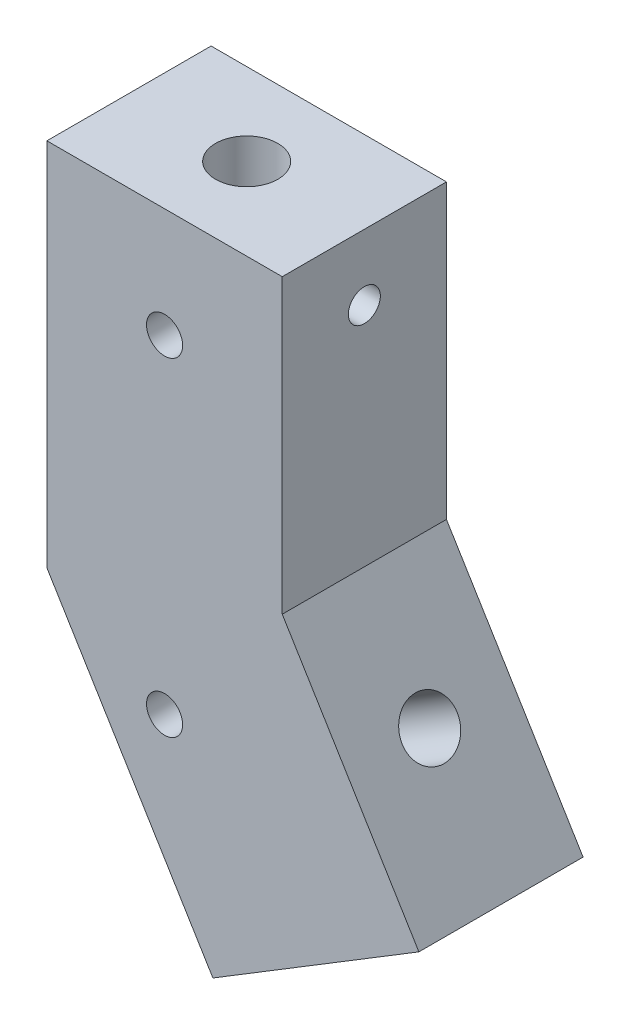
ISO-10303-21;
HEADER;
FILE_DESCRIPTION(('STEP AP214'),'2;1');
FILE_NAME('part.step','',(''),(''),'','','');
FILE_SCHEMA(('AUTOMOTIVE_DESIGN { 1 0 10303 214 1 1 1 1 }'));
ENDSEC;
DATA;
#1=APPLICATION_CONTEXT('core data for automotive mechanical design processes');
#2=APPLICATION_PROTOCOL_DEFINITION('international standard','automotive_design',2000,#1);
#3=PRODUCT_CONTEXT('',#1,'mechanical');
#4=PRODUCT('Part','Part','',(#3));
#5=PRODUCT_RELATED_PRODUCT_CATEGORY('part','',(#4));
#6=PRODUCT_DEFINITION_FORMATION('','',#4);
#7=PRODUCT_DEFINITION_CONTEXT('part definition',#1,'design');
#8=PRODUCT_DEFINITION('design','',#6,#7);
#9=PRODUCT_DEFINITION_SHAPE('','',#8);
#10=(LENGTH_UNIT() NAMED_UNIT(*) SI_UNIT(.MILLI.,.METRE.));
#11=(NAMED_UNIT(*) PLANE_ANGLE_UNIT() SI_UNIT($,.RADIAN.));
#12=(NAMED_UNIT(*) SI_UNIT($,.STERADIAN.) SOLID_ANGLE_UNIT());
#13=UNCERTAINTY_MEASURE_WITH_UNIT(LENGTH_MEASURE(1.E-05),#10,'distance_accuracy_value','');
#14=(GEOMETRIC_REPRESENTATION_CONTEXT(3) GLOBAL_UNCERTAINTY_ASSIGNED_CONTEXT((#13)) GLOBAL_UNIT_ASSIGNED_CONTEXT((#10,
#11,#12)) REPRESENTATION_CONTEXT('',''));
#15=CARTESIAN_POINT('',(0.,0.,0.));
#16=DIRECTION('',(0.,0.,1.));
#17=DIRECTION('',(1.,0.,0.));
#18=AXIS2_PLACEMENT_3D('',#15,#16,#17);
#19=CARTESIAN_POINT('',(20.3073467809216,-542.759067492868,15.));
#20=DIRECTION('',(0.853796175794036,0.520607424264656,0.));
#21=DIRECTION('',(-0.520607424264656,0.853796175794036,0.));
#22=AXIS2_PLACEMENT_3D('',#19,#20,#21);
#23=PLANE('',#22);
#24=CARTESIAN_POINT('',(-4.20268614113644,-502.562613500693,0.));
#25=DIRECTION('',(0.853796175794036,0.520607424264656,0.));
#26=DIRECTION('',(-0.520607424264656,0.853796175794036,0.));
#27=AXIS2_PLACEMENT_3D('',#24,#25,#26);
#28=CIRCLE('',#27,5.02899389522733);
#29=CARTESIAN_POINT('',(-6.82081769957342,-498.268877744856,0.));
#30=VERTEX_POINT('',#29);
#31=EDGE_CURVE('E186',#30,#30,#28,.T.);
#32=ORIENTED_EDGE('',*,*,#31,.T.);
#33=EDGE_LOOP('',(#32));
#34=FACE_BOUND('',#33,.T.);
#35=DIRECTION('',(0.520607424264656,-0.853796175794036,0.));
#36=VECTOR('',#35,1.);
#37=CARTESIAN_POINT('',(20.3073467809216,-542.759067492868,-15.));
#38=LINE('',#37,#36);
#39=CARTESIAN_POINT('',(-21.5,-474.195018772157,-15.));
#40=VERTEX_POINT('',#39);
#41=CARTESIAN_POINT('',(8.82759390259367,-523.93227277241,-15.));
#42=VERTEX_POINT('',#41);
#43=EDGE_CURVE('E108',#40,#42,#38,.T.);
#44=ORIENTED_EDGE('',*,*,#43,.T.);
#45=DIRECTION('',(0.,0.,1.));
#46=VECTOR('',#45,1.);
#47=CARTESIAN_POINT('',(8.82759390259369,-523.93227277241,15.));
#48=LINE('',#47,#46);
#49=CARTESIAN_POINT('',(8.82759390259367,-523.93227277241,15.));
#50=VERTEX_POINT('',#49);
#51=EDGE_CURVE('E190',#42,#50,#48,.T.);
#52=ORIENTED_EDGE('',*,*,#51,.T.);
#53=DIRECTION('',(0.520607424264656,-0.853796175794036,0.));
#54=VECTOR('',#53,1.);
#55=CARTESIAN_POINT('',(20.3073467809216,-542.759067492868,15.));
#56=LINE('',#55,#54);
#57=CARTESIAN_POINT('',(-21.5,-474.195018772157,15.));
#58=VERTEX_POINT('',#57);
#59=EDGE_CURVE('E107',#58,#50,#56,.T.);
#60=ORIENTED_EDGE('',*,*,#59,.F.);
#61=DIRECTION('',(0.,0.,-1.));
#62=VECTOR('',#61,1.);
#63=CARTESIAN_POINT('',(-21.5,-474.195018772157,15.));
#64=LINE('',#63,#62);
#65=EDGE_CURVE('E191',#58,#40,#64,.T.);
#66=ORIENTED_EDGE('',*,*,#65,.T.);
#67=EDGE_LOOP('',(#44,#52,#60,#66));
#68=FACE_BOUND('',#67,.T.);
#69=ADVANCED_FACE('F33',(#34,#68),#23,.F.);
#70=CARTESIAN_POINT('',(-62.7003126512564,-406.626506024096,15.));
#71=DIRECTION('',(0.,-1.,0.));
#72=DIRECTION('',(0.,0.,-1.));
#73=AXIS2_PLACEMENT_3D('',#70,#71,#72);
#74=PLANE('',#73);
#75=CARTESIAN_POINT('',(0.,-406.626506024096,0.));
#76=DIRECTION('',(0.,1.,0.));
#77=DIRECTION('',(0.,0.,1.));
#78=AXIS2_PLACEMENT_3D('',#75,#76,#77);
#79=CIRCLE('',#78,5.68882024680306);
#80=CARTESIAN_POINT('',(0.,-406.626506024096,5.68882024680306));
#81=VERTEX_POINT('',#80);
#82=EDGE_CURVE('E211',#81,#81,#79,.T.);
#83=ORIENTED_EDGE('',*,*,#82,.F.);
#84=EDGE_LOOP('',(#83));
#85=FACE_BOUND('',#84,.T.);
#86=DIRECTION('',(-1.,0.,0.));
#87=VECTOR('',#86,1.);
#88=CARTESIAN_POINT('',(-62.7003126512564,-406.626506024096,15.));
#89=LINE('',#88,#87);
#90=CARTESIAN_POINT('',(21.5,-406.626506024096,15.));
#91=VERTEX_POINT('',#90);
#92=CARTESIAN_POINT('',(-21.5,-406.626506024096,15.));
#93=VERTEX_POINT('',#92);
#94=EDGE_CURVE('E111',#91,#93,#89,.T.);
#95=ORIENTED_EDGE('',*,*,#94,.F.);
#96=DIRECTION('',(0.,0.,-1.));
#97=VECTOR('',#96,1.);
#98=CARTESIAN_POINT('',(21.5,-406.626506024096,15.));
#99=LINE('',#98,#97);
#100=CARTESIAN_POINT('',(21.5,-406.626506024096,-15.));
#101=VERTEX_POINT('',#100);
#102=EDGE_CURVE('E202',#91,#101,#99,.T.);
#103=ORIENTED_EDGE('',*,*,#102,.T.);
#104=DIRECTION('',(-1.,0.,0.));
#105=VECTOR('',#104,1.);
#106=CARTESIAN_POINT('',(-62.7003126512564,-406.626506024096,-15.));
#107=LINE('',#106,#105);
#108=CARTESIAN_POINT('',(-21.5,-406.626506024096,-15.));
#109=VERTEX_POINT('',#108);
#110=EDGE_CURVE('E56',#101,#109,#107,.T.);
#111=ORIENTED_EDGE('',*,*,#110,.T.);
#112=DIRECTION('',(0.,0.,1.));
#113=VECTOR('',#112,1.);
#114=CARTESIAN_POINT('',(-21.5,-406.626506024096,15.));
#115=LINE('',#114,#113);
#116=EDGE_CURVE('E207',#109,#93,#115,.T.);
#117=ORIENTED_EDGE('',*,*,#116,.T.);
#118=EDGE_LOOP('',(#95,#103,#111,#117));
#119=FACE_BOUND('',#118,.T.);
#120=ADVANCED_FACE('F176',(#85,#119),#74,.F.);
#121=CARTESIAN_POINT('',(0.,0.,15.));
#122=DIRECTION('',(0.,0.,1.));
#123=DIRECTION('',(1.,0.,0.));
#124=AXIS2_PLACEMENT_3D('',#121,#122,#123);
#125=PLANE('',#124);
#126=CARTESIAN_POINT('',(0.,-486.626506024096,15.));
#127=DIRECTION('',(0.,0.,1.));
#128=DIRECTION('',(1.,0.,0.));
#129=AXIS2_PLACEMENT_3D('',#126,#127,#128);
#130=CIRCLE('',#129,3.30000000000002);
#131=CARTESIAN_POINT('',(3.30000000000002,-486.626506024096,15.));
#132=VERTEX_POINT('',#131);
#133=EDGE_CURVE('E229',#132,#132,#130,.T.);
#134=ORIENTED_EDGE('',*,*,#133,.F.);
#135=EDGE_LOOP('',(#134));
#136=FACE_BOUND('',#135,.T.);
#137=CARTESIAN_POINT('',(0.,-426.626506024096,15.));
#138=DIRECTION('',(0.,0.,1.));
#139=DIRECTION('',(1.,0.,0.));
#140=AXIS2_PLACEMENT_3D('',#137,#138,#139);
#141=CIRCLE('',#140,3.30000000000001);
#142=CARTESIAN_POINT('',(3.30000000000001,-426.626506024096,15.));
#143=VERTEX_POINT('',#142);
#144=EDGE_CURVE('E232',#143,#143,#141,.T.);
#145=ORIENTED_EDGE('',*,*,#144,.F.);
#146=EDGE_LOOP('',(#145));
#147=FACE_BOUND('',#146,.T.);
#148=DIRECTION('',(0.,-1.,0.));
#149=VECTOR('',#148,1.);
#150=CARTESIAN_POINT('',(21.5,-402.104856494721,15.));
#151=LINE('',#150,#149);
#152=CARTESIAN_POINT('',(21.5,-460.034183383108,15.));
#153=VERTEX_POINT('',#152);
#154=EDGE_CURVE('E91',#91,#153,#151,.T.);
#155=ORIENTED_EDGE('',*,*,#154,.F.);
#156=ORIENTED_EDGE('',*,*,#94,.T.);
#157=DIRECTION('',(0.,1.,0.));
#158=VECTOR('',#157,1.);
#159=CARTESIAN_POINT('',(-21.5,-402.104856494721,15.));
#160=LINE('',#159,#158);
#161=EDGE_CURVE('E204',#58,#93,#160,.T.);
#162=ORIENTED_EDGE('',*,*,#161,.F.);
#163=ORIENTED_EDGE('',*,*,#59,.T.);
#164=DIRECTION('',(-0.853796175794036,-0.520607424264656,0.));
#165=VECTOR('',#164,1.);
#166=CARTESIAN_POINT('',(46.4676009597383,-500.981048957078,15.));
#167=LINE('',#166,#165);
#168=CARTESIAN_POINT('',(46.4676009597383,-500.981048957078,15.));
#169=VERTEX_POINT('',#168);
#170=EDGE_CURVE('E102',#169,#50,#167,.T.);
#171=ORIENTED_EDGE('',*,*,#170,.F.);
#172=DIRECTION('',(0.520607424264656,-0.853796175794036,0.));
#173=VECTOR('',#172,1.);
#174=CARTESIAN_POINT('',(46.4676009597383,-500.981048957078,15.));
#175=LINE('',#174,#173);
#176=EDGE_CURVE('E196',#153,#169,#175,.T.);
#177=ORIENTED_EDGE('',*,*,#176,.F.);
#178=EDGE_LOOP('',(#155,#156,#162,#163,#171,#177));
#179=FACE_BOUND('',#178,.T.);
#180=ADVANCED_FACE('F181',(#136,#147,#179),#125,.T.);
#181=CARTESIAN_POINT('',(0.,0.,-15.));
#182=DIRECTION('',(0.,0.,1.));
#183=DIRECTION('',(1.,0.,0.));
#184=AXIS2_PLACEMENT_3D('',#181,#182,#183);
#185=PLANE('',#184);
#186=CARTESIAN_POINT('',(0.,-486.626506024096,-15.));
#187=DIRECTION('',(0.,0.,1.));
#188=DIRECTION('',(1.,0.,0.));
#189=AXIS2_PLACEMENT_3D('',#186,#187,#188);
#190=CIRCLE('',#189,3.30000000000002);
#191=CARTESIAN_POINT('',(3.30000000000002,-486.626506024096,-15.));
#192=VERTEX_POINT('',#191);
#193=EDGE_CURVE('E233',#192,#192,#190,.T.);
#194=ORIENTED_EDGE('',*,*,#193,.T.);
#195=EDGE_LOOP('',(#194));
#196=FACE_BOUND('',#195,.T.);
#197=CARTESIAN_POINT('',(0.,-426.626506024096,-15.));
#198=DIRECTION('',(0.,0.,1.));
#199=DIRECTION('',(1.,0.,0.));
#200=AXIS2_PLACEMENT_3D('',#197,#198,#199);
#201=CIRCLE('',#200,3.30000000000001);
#202=CARTESIAN_POINT('',(3.30000000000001,-426.626506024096,-15.));
#203=VERTEX_POINT('',#202);
#204=EDGE_CURVE('E197',#203,#203,#201,.T.);
#205=ORIENTED_EDGE('',*,*,#204,.T.);
#206=EDGE_LOOP('',(#205));
#207=FACE_BOUND('',#206,.T.);
#208=ORIENTED_EDGE('',*,*,#110,.F.);
#209=DIRECTION('',(0.,-1.,0.));
#210=VECTOR('',#209,1.);
#211=CARTESIAN_POINT('',(21.5,0.,-15.));
#212=LINE('',#211,#210);
#213=CARTESIAN_POINT('',(21.5,-460.034183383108,-15.));
#214=VERTEX_POINT('',#213);
#215=EDGE_CURVE('E11',#101,#214,#212,.T.);
#216=ORIENTED_EDGE('',*,*,#215,.T.);
#217=DIRECTION('',(0.520607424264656,-0.853796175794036,0.));
#218=VECTOR('',#217,1.);
#219=CARTESIAN_POINT('',(46.4676009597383,-500.981048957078,-15.));
#220=LINE('',#219,#218);
#221=CARTESIAN_POINT('',(46.4676009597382,-500.981048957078,-15.));
#222=VERTEX_POINT('',#221);
#223=EDGE_CURVE('E98',#214,#222,#220,.T.);
#224=ORIENTED_EDGE('',*,*,#223,.T.);
#225=DIRECTION('',(-0.853796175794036,-0.520607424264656,0.));
#226=VECTOR('',#225,1.);
#227=CARTESIAN_POINT('',(46.4676009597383,-500.981048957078,-15.));
#228=LINE('',#227,#226);
#229=EDGE_CURVE('E48',#222,#42,#228,.T.);
#230=ORIENTED_EDGE('',*,*,#229,.T.);
#231=ORIENTED_EDGE('',*,*,#43,.F.);
#232=DIRECTION('',(0.,1.,0.));
#233=VECTOR('',#232,1.);
#234=CARTESIAN_POINT('',(-21.5,0.,-15.));
#235=LINE('',#234,#233);
#236=EDGE_CURVE('E41',#40,#109,#235,.T.);
#237=ORIENTED_EDGE('',*,*,#236,.T.);
#238=EDGE_LOOP('',(#208,#216,#224,#230,#231,#237));
#239=FACE_BOUND('',#238,.T.);
#240=ADVANCED_FACE('F104',(#196,#207,#239),#185,.F.);
#241=CARTESIAN_POINT('',(0.,-436.626506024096,0.));
#242=DIRECTION('',(0.,1.,0.));
#243=DIRECTION('',(0.,0.,1.));
#244=AXIS2_PLACEMENT_3D('',#241,#242,#243);
#245=CYLINDRICAL_SURFACE('',#244,5.68882024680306);
#246=CARTESIAN_POINT('',(4.87924695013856,-418.626506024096,2.925));
#247=CARTESIAN_POINT('',(4.87924763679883,-418.702409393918,2.92499936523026));
#248=CARTESIAN_POINT('',(4.88102612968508,-418.778317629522,2.92203955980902));
#249=CARTESIAN_POINT('',(4.88806151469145,-418.929524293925,2.91025242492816));
#250=CARTESIAN_POINT('',(4.89331989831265,-419.004822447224,2.90142257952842));
#251=CARTESIAN_POINT('',(4.91407437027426,-419.229115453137,2.86624275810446));
#252=CARTESIAN_POINT('',(4.93454934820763,-419.376393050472,2.83120272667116));
#253=CARTESIAN_POINT('',(4.98578154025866,-419.661208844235,2.73994966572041));
#254=CARTESIAN_POINT('',(5.01648149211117,-419.798796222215,2.6838543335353));
#255=CARTESIAN_POINT('',(5.08460156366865,-420.06260147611,2.55244438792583));
#256=CARTESIAN_POINT('',(5.12202236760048,-420.188818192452,2.47712781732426));
#257=CARTESIAN_POINT('',(5.20336614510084,-420.438441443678,2.30169188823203));
#258=CARTESIAN_POINT('',(5.24757155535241,-420.560635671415,2.19997889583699));
#259=CARTESIAN_POINT('',(5.33522835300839,-420.787184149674,1.97794514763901));
#260=CARTESIAN_POINT('',(5.37867933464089,-420.891529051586,1.85761470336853));
#261=CARTESIAN_POINT('',(5.46368560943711,-421.086809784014,1.59114108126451));
#262=CARTESIAN_POINT('',(5.50487675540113,-421.176230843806,1.44376068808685));
#263=CARTESIAN_POINT('',(5.57701230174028,-421.328453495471,1.13353212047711));
#264=CARTESIAN_POINT('',(5.60796353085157,-421.391272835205,0.970694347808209));
#265=CARTESIAN_POINT('',(5.65408918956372,-421.483628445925,0.647029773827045));
#266=CARTESIAN_POINT('',(5.67026752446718,-421.515296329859,0.486957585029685));
#267=CARTESIAN_POINT('',(5.68879196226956,-421.551494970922,0.163019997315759));
#268=CARTESIAN_POINT('',(5.69114699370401,-421.556043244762,-0.000842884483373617));
#269=CARTESIAN_POINT('',(5.68221256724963,-421.538638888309,-0.311579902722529));
#270=CARTESIAN_POINT('',(5.67215625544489,-421.519081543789,-0.458632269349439));
#271=CARTESIAN_POINT('',(5.64142391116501,-421.458342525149,-0.74702399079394));
#272=CARTESIAN_POINT('',(5.62074707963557,-421.417159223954,-0.888362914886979));
#273=CARTESIAN_POINT('',(5.57031092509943,-421.314135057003,-1.16369162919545));
#274=CARTESIAN_POINT('',(5.54043575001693,-421.252029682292,-1.29756034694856));
#275=CARTESIAN_POINT('',(5.47425377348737,-421.109326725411,-1.55328477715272));
#276=CARTESIAN_POINT('',(5.43794472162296,-421.028722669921,-1.67513626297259));
#277=CARTESIAN_POINT('',(5.35804101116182,-420.842207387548,-1.91617775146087));
#278=CARTESIAN_POINT('',(5.31408100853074,-420.734586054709,-2.03392508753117));
#279=CARTESIAN_POINT('',(5.22605480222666,-420.501673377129,-2.2504932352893));
#280=CARTESIAN_POINT('',(5.18198854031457,-420.376367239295,-2.349298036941));
#281=CARTESIAN_POINT('',(5.09533294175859,-420.100803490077,-2.53203530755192));
#282=CARTESIAN_POINT('',(5.05306266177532,-419.949413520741,-2.61444351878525));
#283=CARTESIAN_POINT('',(4.99788932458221,-419.711775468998,-2.71759057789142));
#284=CARTESIAN_POINT('',(4.98086776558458,-419.630787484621,-2.74856600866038));
#285=CARTESIAN_POINT('',(4.95024593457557,-419.46581240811,-2.80334212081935));
#286=CARTESIAN_POINT('',(4.93664349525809,-419.381827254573,-2.82714734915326));
#287=CARTESIAN_POINT('',(4.91439721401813,-419.218346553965,-2.86562908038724));
#288=CARTESIAN_POINT('',(4.90544398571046,-419.13902855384,-2.88088305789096));
#289=CARTESIAN_POINT('',(4.89132297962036,-418.979107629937,-2.90479410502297));
#290=CARTESIAN_POINT('',(4.88615317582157,-418.898505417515,-2.91345470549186));
#291=CARTESIAN_POINT('',(4.87982349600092,-418.736733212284,-2.92404500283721));
#292=CARTESIAN_POINT('',(4.87866181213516,-418.655563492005,-2.92597773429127));
#293=CARTESIAN_POINT('',(4.88038663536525,-418.493413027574,-2.92309711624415));
#294=CARTESIAN_POINT('',(4.88327282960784,-418.412432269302,-2.91828428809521));
#295=CARTESIAN_POINT('',(4.89669192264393,-418.190076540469,-2.89575814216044));
#296=CARTESIAN_POINT('',(4.91136993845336,-418.049589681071,-2.87101916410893));
#297=CARTESIAN_POINT('',(4.95109180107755,-417.775154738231,-2.80194757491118));
#298=CARTESIAN_POINT('',(4.97613926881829,-417.641208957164,-2.75760811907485));
#299=CARTESIAN_POINT('',(5.03508609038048,-417.376525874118,-2.64850660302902));
#300=CARTESIAN_POINT('',(5.06933820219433,-417.24621621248,-2.58290248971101));
#301=CARTESIAN_POINT('',(5.14256077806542,-416.997696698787,-2.43385168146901));
#302=CARTESIAN_POINT('',(5.18153366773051,-416.87949312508,-2.35039579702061));
#303=CARTESIAN_POINT('',(5.26611458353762,-416.641850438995,-2.15488168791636));
#304=CARTESIAN_POINT('',(5.31190883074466,-416.524392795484,-2.04048432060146));
#305=CARTESIAN_POINT('',(5.40048104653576,-416.309672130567,-1.79297447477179));
#306=CARTESIAN_POINT('',(5.44325779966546,-416.212417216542,-1.65985451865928));
#307=CARTESIAN_POINT('',(5.52273975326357,-416.038104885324,-1.37290350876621));
#308=CARTESIAN_POINT('',(5.55920341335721,-415.961803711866,-1.21854127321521));
#309=CARTESIAN_POINT('',(5.62007271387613,-415.837034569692,-0.896757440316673));
#310=CARTESIAN_POINT('',(5.64448952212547,-415.788540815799,-0.729348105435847));
#311=CARTESIAN_POINT('',(5.67663699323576,-415.725158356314,-0.403373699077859));
#312=CARTESIAN_POINT('',(5.6857318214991,-415.707516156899,-0.245478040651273));
#313=CARTESIAN_POINT('',(5.69057481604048,-415.698090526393,0.0712640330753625));
#314=CARTESIAN_POINT('',(5.68632822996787,-415.706296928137,0.230110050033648));
#315=CARTESIAN_POINT('',(5.66575542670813,-415.746576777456,0.532136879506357));
#316=CARTESIAN_POINT('',(5.65032303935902,-415.776885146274,0.675620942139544));
#317=CARTESIAN_POINT('',(5.60983350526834,-415.858038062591,0.95520026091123));
#318=CARTESIAN_POINT('',(5.58477505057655,-415.908885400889,1.09129451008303));
#319=CARTESIAN_POINT('',(5.52599106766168,-416.031789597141,1.35852398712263));
#320=CARTESIAN_POINT('',(5.49195273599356,-416.104629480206,1.48922815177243));
#321=CARTESIAN_POINT('',(5.41866907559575,-416.268478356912,1.7370754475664));
#322=CARTESIAN_POINT('',(5.37942139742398,-416.35949555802,1.8542124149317));
#323=CARTESIAN_POINT('',(5.29472053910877,-416.568104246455,2.08451124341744));
#324=CARTESIAN_POINT('',(5.24904713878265,-416.687477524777,2.19598339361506));
#325=CARTESIAN_POINT('',(5.159894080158,-416.943676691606,2.39799592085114));
#326=CARTESIAN_POINT('',(5.11641659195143,-417.0805193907,2.48851589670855));
#327=CARTESIAN_POINT('',(5.03509255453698,-417.375180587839,2.64934180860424));
#328=CARTESIAN_POINT('',(4.9975465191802,-417.533625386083,2.71867714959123));
#329=CARTESIAN_POINT('',(4.95147811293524,-417.779970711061,2.80116320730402));
#330=CARTESIAN_POINT('',(4.93783801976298,-417.86345395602,2.82506066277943));
#331=CARTESIAN_POINT('',(4.91453238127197,-418.032723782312,2.86541389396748));
#332=CARTESIAN_POINT('',(4.90486411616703,-418.118508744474,2.88187476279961));
#333=CARTESIAN_POINT('',(4.89142663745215,-418.274625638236,2.90460953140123));
#334=CARTESIAN_POINT('',(4.88687323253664,-418.344696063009,2.91224664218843));
#335=CARTESIAN_POINT('',(4.8807829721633,-418.485344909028,2.92244233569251));
#336=CARTESIAN_POINT('',(4.87924631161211,-418.5559233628,2.92500059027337));
#337=CARTESIAN_POINT('',(4.87924695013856,-418.626506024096,2.925));
#338=B_SPLINE_CURVE_WITH_KNOTS('',3,(#246,#247,#248,#249,#250,#251,#252,#253,#254,#255,#256,
#257,#258,#259,#260,#261,#262,#263,#264,#265,#266,#267,#268,#269,#270,#271,#272,#273,#274,#275,
#276,#277,#278,#279,#280,#281,#282,#283,#284,#285,#286,#287,#288,#289,#290,#291,#292,#293,#294,
#295,#296,#297,#298,#299,#300,#301,#302,#303,#304,#305,#306,#307,#308,#309,#310,#311,#312,#313,
#314,#315,#316,#317,#318,#319,#320,#321,#322,#323,#324,#325,#326,#327,#328,#329,#330,#331,#332,
#333,#334,#335,#336,#337),.UNSPECIFIED.,.T.,.F.,(4,2,2,2,2,2,2,2,2,2,2,2,2,2,2,2,2,2,2,2,2,2,2,
2,2,2,2,2,2,2,2,2,2,2,2,2,2,2,2,2,2,2,2,2,2,4),(0.,0.227632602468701,0.455362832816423,
0.911165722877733,1.36445776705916,1.81779598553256,2.31080256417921,2.80406657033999,
3.33299103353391,3.86156205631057,4.35073934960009,4.83960064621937,5.28356862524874,
5.72757001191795,6.17740964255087,6.62740692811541,7.12169986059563,7.61640874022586,
8.145730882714,8.41049294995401,8.67508676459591,8.91853643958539,9.16185565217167,
9.40506510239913,9.64825575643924,10.0763225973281,10.5045390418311,10.9523601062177,
11.400412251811,11.9088638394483,12.4175190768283,12.9426499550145,13.4672931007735,
13.9421237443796,14.4167676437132,14.8571593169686,15.2976108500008,15.7560927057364,
16.2147820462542,16.7213261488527,17.2283614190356,17.7559951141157,18.0193431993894,
18.2825106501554,18.4941728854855,18.7058487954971),.UNSPECIFIED.);
#339=CARTESIAN_POINT('',(4.87924695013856,-418.626506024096,2.925));
#340=VERTEX_POINT('',#339);
#341=EDGE_CURVE('E240',#340,#340,#338,.T.);
#342=ORIENTED_EDGE('',*,*,#341,.T.);
#343=EDGE_LOOP('',(#342));
#344=FACE_BOUND('',#343,.T.);
#345=CARTESIAN_POINT('',(-4.87924695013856,-418.626506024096,2.925));
#346=CARTESIAN_POINT('',(-4.87924763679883,-418.550602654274,2.92499936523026));
#347=CARTESIAN_POINT('',(-4.88102612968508,-418.47469441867,2.92203955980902));
#348=CARTESIAN_POINT('',(-4.88806151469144,-418.323487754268,2.91025242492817));
#349=CARTESIAN_POINT('',(-4.89331989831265,-418.248189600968,2.90142257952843));
#350=CARTESIAN_POINT('',(-4.91407437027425,-418.023896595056,2.86624275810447));
#351=CARTESIAN_POINT('',(-4.93454934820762,-417.87661899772,2.83120272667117));
#352=CARTESIAN_POINT('',(-4.98578154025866,-417.591803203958,2.73994966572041));
#353=CARTESIAN_POINT('',(-5.01648149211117,-417.454215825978,2.6838543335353));
#354=CARTESIAN_POINT('',(-5.08460156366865,-417.190410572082,2.55244438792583));
#355=CARTESIAN_POINT('',(-5.12202236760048,-417.064193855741,2.47712781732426));
#356=CARTESIAN_POINT('',(-5.20336614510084,-416.814570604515,2.30169188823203));
#357=CARTESIAN_POINT('',(-5.24757155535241,-416.692376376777,2.19997889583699));
#358=CARTESIAN_POINT('',(-5.33522835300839,-416.465827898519,1.97794514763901));
#359=CARTESIAN_POINT('',(-5.37867933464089,-416.361482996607,1.85761470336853));
#360=CARTESIAN_POINT('',(-5.46368560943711,-416.166202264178,1.59114108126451));
#361=CARTESIAN_POINT('',(-5.50487675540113,-416.076781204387,1.44376068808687));
#362=CARTESIAN_POINT('',(-5.57701230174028,-415.924558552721,1.13353212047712));
#363=CARTESIAN_POINT('',(-5.60796353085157,-415.861739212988,0.970694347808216));
#364=CARTESIAN_POINT('',(-5.65408918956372,-415.769383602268,0.647029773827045));
#365=CARTESIAN_POINT('',(-5.67026752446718,-415.737715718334,0.486957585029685));
#366=CARTESIAN_POINT('',(-5.68879196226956,-415.701517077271,0.16301999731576));
#367=CARTESIAN_POINT('',(-5.69114699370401,-415.696968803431,-0.000842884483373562));
#368=CARTESIAN_POINT('',(-5.68221256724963,-415.714373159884,-0.311579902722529));
#369=CARTESIAN_POINT('',(-5.67215625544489,-415.733930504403,-0.458632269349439));
#370=CARTESIAN_POINT('',(-5.64142391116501,-415.794669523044,-0.74702399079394));
#371=CARTESIAN_POINT('',(-5.62074707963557,-415.835852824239,-0.888362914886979));
#372=CARTESIAN_POINT('',(-5.57031092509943,-415.93887699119,-1.16369162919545));
#373=CARTESIAN_POINT('',(-5.54043575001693,-416.000982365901,-1.29756034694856));
#374=CARTESIAN_POINT('',(-5.47425377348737,-416.143685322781,-1.55328477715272));
#375=CARTESIAN_POINT('',(-5.43794472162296,-416.224289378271,-1.67513626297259));
#376=CARTESIAN_POINT('',(-5.35804101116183,-416.410804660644,-1.91617775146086));
#377=CARTESIAN_POINT('',(-5.31408100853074,-416.518425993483,-2.03392508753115));
#378=CARTESIAN_POINT('',(-5.22605480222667,-416.751338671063,-2.25049323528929));
#379=CARTESIAN_POINT('',(-5.18198854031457,-416.876644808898,-2.34929803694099));
#380=CARTESIAN_POINT('',(-5.09533294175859,-417.152208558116,-2.53203530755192));
#381=CARTESIAN_POINT('',(-5.05306266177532,-417.303598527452,-2.61444351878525));
#382=CARTESIAN_POINT('',(-4.99788932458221,-417.541236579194,-2.71759057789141));
#383=CARTESIAN_POINT('',(-4.98086776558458,-417.622224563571,-2.74856600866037));
#384=CARTESIAN_POINT('',(-4.95024593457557,-417.787199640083,-2.80334212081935));
#385=CARTESIAN_POINT('',(-4.93664349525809,-417.871184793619,-2.82714734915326));
#386=CARTESIAN_POINT('',(-4.91439721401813,-418.034665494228,-2.86562908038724));
#387=CARTESIAN_POINT('',(-4.90544398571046,-418.113983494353,-2.88088305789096));
#388=CARTESIAN_POINT('',(-4.89132297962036,-418.273904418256,-2.90479410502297));
#389=CARTESIAN_POINT('',(-4.88615317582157,-418.354506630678,-2.91345470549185));
#390=CARTESIAN_POINT('',(-4.87982349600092,-418.516278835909,-2.92404500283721));
#391=CARTESIAN_POINT('',(-4.87866181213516,-418.597448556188,-2.92597773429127));
#392=CARTESIAN_POINT('',(-4.88038663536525,-418.759599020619,-2.92309711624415));
#393=CARTESIAN_POINT('',(-4.88327282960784,-418.84057977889,-2.91828428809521));
#394=CARTESIAN_POINT('',(-4.89669192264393,-419.062935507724,-2.89575814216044));
#395=CARTESIAN_POINT('',(-4.91136993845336,-419.203422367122,-2.87101916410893));
#396=CARTESIAN_POINT('',(-4.95109180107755,-419.477857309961,-2.80194757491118));
#397=CARTESIAN_POINT('',(-4.97613926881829,-419.611803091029,-2.75760811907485));
#398=CARTESIAN_POINT('',(-5.03508609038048,-419.876486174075,-2.64850660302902));
#399=CARTESIAN_POINT('',(-5.06933820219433,-420.006795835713,-2.58290248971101));
#400=CARTESIAN_POINT('',(-5.14256077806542,-420.255315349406,-2.43385168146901));
#401=CARTESIAN_POINT('',(-5.18153366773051,-420.373518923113,-2.35039579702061));
#402=CARTESIAN_POINT('',(-5.26611458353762,-420.611161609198,-2.15488168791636));
#403=CARTESIAN_POINT('',(-5.31190883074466,-420.728619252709,-2.04048432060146));
#404=CARTESIAN_POINT('',(-5.40048104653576,-420.943339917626,-1.79297447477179));
#405=CARTESIAN_POINT('',(-5.44325779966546,-421.040594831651,-1.65985451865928));
#406=CARTESIAN_POINT('',(-5.52273975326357,-421.214907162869,-1.37290350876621));
#407=CARTESIAN_POINT('',(-5.55920341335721,-421.291208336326,-1.21854127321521));
#408=CARTESIAN_POINT('',(-5.62007271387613,-421.415977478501,-0.896757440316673));
#409=CARTESIAN_POINT('',(-5.64448952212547,-421.464471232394,-0.729348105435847));
#410=CARTESIAN_POINT('',(-5.67663699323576,-421.527853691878,-0.403373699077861));
#411=CARTESIAN_POINT('',(-5.6857318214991,-421.545495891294,-0.245478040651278));
#412=CARTESIAN_POINT('',(-5.69057481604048,-421.5549215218,0.071264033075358));
#413=CARTESIAN_POINT('',(-5.68632822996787,-421.546715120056,0.230110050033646));
#414=CARTESIAN_POINT('',(-5.66575542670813,-421.506435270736,0.532136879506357));
#415=CARTESIAN_POINT('',(-5.65032303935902,-421.476126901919,0.675620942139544));
#416=CARTESIAN_POINT('',(-5.60983350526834,-421.394973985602,0.95520026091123));
#417=CARTESIAN_POINT('',(-5.58477505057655,-421.344126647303,1.09129451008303));
#418=CARTESIAN_POINT('',(-5.52599106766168,-421.221222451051,1.35852398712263));
#419=CARTESIAN_POINT('',(-5.49195273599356,-421.148382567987,1.48922815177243));
#420=CARTESIAN_POINT('',(-5.41866907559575,-420.984533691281,1.7370754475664));
#421=CARTESIAN_POINT('',(-5.37942139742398,-420.893516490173,1.8542124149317));
#422=CARTESIAN_POINT('',(-5.29472053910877,-420.684907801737,2.08451124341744));
#423=CARTESIAN_POINT('',(-5.24904713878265,-420.565534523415,2.19598339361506));
#424=CARTESIAN_POINT('',(-5.159894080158,-420.309335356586,2.39799592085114));
#425=CARTESIAN_POINT('',(-5.11641659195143,-420.172492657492,2.48851589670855));
#426=CARTESIAN_POINT('',(-5.03509255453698,-419.877831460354,2.64934180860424));
#427=CARTESIAN_POINT('',(-4.9975465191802,-419.719386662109,2.71867714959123));
#428=CARTESIAN_POINT('',(-4.95147811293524,-419.473041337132,2.80116320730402));
#429=CARTESIAN_POINT('',(-4.93783801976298,-419.389558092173,2.82506066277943));
#430=CARTESIAN_POINT('',(-4.91453238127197,-419.220288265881,2.86541389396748));
#431=CARTESIAN_POINT('',(-4.90486411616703,-419.134503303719,2.88187476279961));
#432=CARTESIAN_POINT('',(-4.89142663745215,-418.978386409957,2.90460953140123));
#433=CARTESIAN_POINT('',(-4.88687323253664,-418.908315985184,2.91224664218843));
#434=CARTESIAN_POINT('',(-4.8807829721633,-418.767667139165,2.92244233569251));
#435=CARTESIAN_POINT('',(-4.87924631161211,-418.697088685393,2.92500059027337));
#436=CARTESIAN_POINT('',(-4.87924695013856,-418.626506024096,2.925));
#437=B_SPLINE_CURVE_WITH_KNOTS('',3,(#345,#346,#347,#348,#349,#350,#351,#352,#353,#354,#355,
#356,#357,#358,#359,#360,#361,#362,#363,#364,#365,#366,#367,#368,#369,#370,#371,#372,#373,#374,
#375,#376,#377,#378,#379,#380,#381,#382,#383,#384,#385,#386,#387,#388,#389,#390,#391,#392,#393,
#394,#395,#396,#397,#398,#399,#400,#401,#402,#403,#404,#405,#406,#407,#408,#409,#410,#411,#412,
#413,#414,#415,#416,#417,#418,#419,#420,#421,#422,#423,#424,#425,#426,#427,#428,#429,#430,#431,
#432,#433,#434,#435,#436),.UNSPECIFIED.,.T.,.F.,(4,2,2,2,2,2,2,2,2,2,2,2,2,2,2,2,2,2,2,2,2,2,2,
2,2,2,2,2,2,2,2,2,2,2,2,2,2,2,2,2,2,2,2,2,2,4),(0.,0.227632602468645,0.455362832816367,
0.911165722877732,1.36445776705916,1.81779598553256,2.31080256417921,2.80406657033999,
3.33299103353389,3.86156205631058,4.35073934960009,4.83960064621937,5.28356862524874,
5.72757001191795,6.17740964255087,6.62740692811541,7.12169986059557,7.61640874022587,
8.14573088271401,8.41049294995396,8.67508676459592,8.9185364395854,9.16185565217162,
9.40506510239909,9.64825575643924,10.0763225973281,10.5045390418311,10.9523601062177,
11.400412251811,11.9088638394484,12.4175190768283,12.9426499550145,13.4672931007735,
13.9421237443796,14.4167676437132,14.8571593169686,15.2976108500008,15.7560927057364,
16.2147820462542,16.7213261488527,17.2283614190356,17.7559951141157,18.0193431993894,
18.2825106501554,18.4941728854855,18.7058487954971),.UNSPECIFIED.);
#438=CARTESIAN_POINT('',(-4.87924695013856,-418.626506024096,2.925));
#439=VERTEX_POINT('',#438);
#440=EDGE_CURVE('E243',#439,#439,#437,.T.);
#441=ORIENTED_EDGE('',*,*,#440,.T.);
#442=EDGE_LOOP('',(#441));
#443=FACE_BOUND('',#442,.T.);
#444=CARTESIAN_POINT('',(0.,-429.926506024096,5.68882024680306));
#445=CARTESIAN_POINT('',(0.0849285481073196,-429.926505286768,5.68881957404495));
#446=CARTESIAN_POINT('',(0.169877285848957,-429.9232223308,5.68691345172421));
#447=CARTESIAN_POINT('',(0.339136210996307,-429.910132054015,5.67933520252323));
#448=CARTESIAN_POINT('',(0.423446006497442,-429.900321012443,5.67366092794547));
#449=CARTESIAN_POINT('',(0.590903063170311,-429.874277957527,5.65867330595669));
#450=CARTESIAN_POINT('',(0.674047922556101,-429.858034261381,5.64935333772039));
#451=CARTESIAN_POINT('',(0.838430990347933,-429.819338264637,5.6273088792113));
#452=CARTESIAN_POINT('',(0.919668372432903,-429.796883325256,5.61458294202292));
#453=CARTESIAN_POINT('',(1.15885797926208,-429.720836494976,5.57187316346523));
#454=CARTESIAN_POINT('',(1.31328046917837,-429.658404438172,5.53726317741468));
#455=CARTESIAN_POINT('',(1.60894693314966,-429.512427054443,5.45870381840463));
#456=CARTESIAN_POINT('',(1.75019387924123,-429.428886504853,5.41475655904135));
#457=CARTESIAN_POINT('',(2.02735493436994,-429.236173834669,5.31748147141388));
#458=CARTESIAN_POINT('',(2.16211305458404,-429.125568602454,5.26370147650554));
#459=CARTESIAN_POINT('',(2.41228681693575,-428.885054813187,5.15385913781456));
#460=CARTESIAN_POINT('',(2.52767896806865,-428.755123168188,5.09779412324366));
#461=CARTESIAN_POINT('',(2.74902645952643,-428.462326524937,4.9822483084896));
#462=CARTESIAN_POINT('',(2.85244843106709,-428.297399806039,4.92309574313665));
#463=CARTESIAN_POINT('',(3.02967413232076,-427.949044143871,4.81606937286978));
#464=CARTESIAN_POINT('',(3.10352369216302,-427.76564438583,4.76817816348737));
#465=CARTESIAN_POINT('',(3.20482250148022,-427.428193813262,4.70049164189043));
#466=CARTESIAN_POINT('',(3.23900383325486,-427.276950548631,4.67678407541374));
#467=CARTESIAN_POINT('',(3.2857755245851,-426.969668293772,4.64405051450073));
#468=CARTESIAN_POINT('',(3.29839010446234,-426.813634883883,4.63500805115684));
#469=CARTESIAN_POINT('',(3.30132209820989,-426.501012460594,4.63292063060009));
#470=CARTESIAN_POINT('',(3.29160537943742,-426.34442296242,4.63990016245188));
#471=CARTESIAN_POINT('',(3.25039468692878,-426.035528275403,4.66885583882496));
#472=CARTESIAN_POINT('',(3.21888529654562,-425.883226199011,4.69084259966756));
#473=CARTESIAN_POINT('',(3.13594858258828,-425.587627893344,4.74667773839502));
#474=CARTESIAN_POINT('',(3.08464936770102,-425.444280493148,4.7804496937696));
#475=CARTESIAN_POINT('',(2.96394456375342,-425.167801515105,4.85621023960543));
#476=CARTESIAN_POINT('',(2.89453213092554,-425.034673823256,4.89820193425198));
#477=CARTESIAN_POINT('',(2.72635820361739,-424.759119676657,4.99404266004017));
#478=CARTESIAN_POINT('',(2.62464560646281,-424.618774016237,5.04870546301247));
#479=CARTESIAN_POINT('',(2.40076819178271,-424.355778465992,5.15893478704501));
#480=CARTESIAN_POINT('',(2.27858526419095,-424.233144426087,5.21450206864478));
#481=CARTESIAN_POINT('',(1.9993788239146,-423.993990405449,5.32826786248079));
#482=CARTESIAN_POINT('',(1.83992745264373,-423.880012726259,5.38596907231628));
#483=CARTESIAN_POINT('',(1.58567081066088,-423.7307603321,5.46408700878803));
#484=CARTESIAN_POINT('',(1.49836676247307,-423.68461421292,5.48872897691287));
#485=CARTESIAN_POINT('',(1.31923428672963,-423.600054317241,5.53451136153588));
#486=CARTESIAN_POINT('',(1.22740865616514,-423.561635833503,5.55565390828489));
#487=CARTESIAN_POINT('',(1.04619807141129,-423.495348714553,5.59250540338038));
#488=CARTESIAN_POINT('',(0.957063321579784,-423.466944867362,5.60848389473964));
#489=CARTESIAN_POINT('',(0.776146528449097,-423.417709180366,5.63636767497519));
#490=CARTESIAN_POINT('',(0.684365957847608,-423.396873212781,5.64827518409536));
#491=CARTESIAN_POINT('',(0.498959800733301,-423.363085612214,5.66766239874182));
#492=CARTESIAN_POINT('',(0.4053353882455,-423.350129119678,5.67514483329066));
#493=CARTESIAN_POINT('',(0.217070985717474,-423.332296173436,5.68545873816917));
#494=CARTESIAN_POINT('',(0.122431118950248,-423.32741874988,5.68829076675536));
#495=CARTESIAN_POINT('',(-0.0550020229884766,-423.325926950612,5.68915617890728));
#496=CARTESIAN_POINT('',(-0.137785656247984,-423.328348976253,5.6877491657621));
#497=CARTESIAN_POINT('',(-0.302808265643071,-423.339385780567,5.68135722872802));
#498=CARTESIAN_POINT('',(-0.38504705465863,-423.34800258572,5.67637113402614));
#499=CARTESIAN_POINT('',(-0.62995718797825,-423.3830100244,5.65619476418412));
#500=CARTESIAN_POINT('',(-0.791005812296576,-423.418556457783,5.63578693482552));
#501=CARTESIAN_POINT('',(-1.10184063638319,-423.511708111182,5.5832967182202));
#502=CARTESIAN_POINT('',(-1.25175433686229,-423.568992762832,5.55138431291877));
#503=CARTESIAN_POINT('',(-1.53992727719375,-423.703508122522,5.47844873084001));
#504=CARTESIAN_POINT('',(-1.6781838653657,-423.780743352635,5.43742348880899));
#505=CARTESIAN_POINT('',(-1.95463621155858,-423.962015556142,5.34466958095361));
#506=CARTESIAN_POINT('',(-2.0913219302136,-424.068007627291,5.29227086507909));
#507=CARTESIAN_POINT('',(-2.3460287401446,-424.299319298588,5.18439951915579));
#508=CARTESIAN_POINT('',(-2.46402787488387,-424.424661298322,5.12892337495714));
#509=CARTESIAN_POINT('',(-2.6921634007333,-424.708386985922,5.01329485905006));
#510=CARTESIAN_POINT('',(-2.79975204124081,-424.868922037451,4.95335771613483));
#511=CARTESIAN_POINT('',(-2.98626017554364,-425.208863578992,4.84321136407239));
#512=CARTESIAN_POINT('',(-3.06521585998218,-425.38824587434,4.7929899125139));
#513=CARTESIAN_POINT('',(-3.1772959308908,-425.721674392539,4.71921276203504));
#514=CARTESIAN_POINT('',(-3.21662453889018,-425.872874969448,4.69224531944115));
#515=CARTESIAN_POINT('',(-3.27354234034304,-426.181081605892,4.65272321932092));
#516=CARTESIAN_POINT('',(-3.29115793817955,-426.338080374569,4.64015105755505));
#517=CARTESIAN_POINT('',(-3.30367626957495,-426.653853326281,4.63124932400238));
#518=CARTESIAN_POINT('',(-3.29852243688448,-426.812630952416,4.63496020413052));
#519=CARTESIAN_POINT('',(-3.2656964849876,-427.126697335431,4.65814116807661));
#520=CARTESIAN_POINT('',(-3.23801043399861,-427.281983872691,4.67762100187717));
#521=CARTESIAN_POINT('',(-3.16262444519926,-427.580962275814,4.72889694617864));
#522=CARTESIAN_POINT('',(-3.11546267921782,-427.724850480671,4.76036022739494));
#523=CARTESIAN_POINT('',(-3.00298580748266,-428.002952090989,4.83209990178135));
#524=CARTESIAN_POINT('',(-2.93766418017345,-428.137161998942,4.87237945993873));
#525=CARTESIAN_POINT('',(-2.77906527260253,-428.414263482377,4.96478858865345));
#526=CARTESIAN_POINT('',(-2.68302595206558,-428.555283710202,5.01778733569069));
#527=CARTESIAN_POINT('',(-2.4708085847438,-428.820590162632,5.12561903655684));
#528=CARTESIAN_POINT('',(-2.35461216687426,-428.944860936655,5.18045362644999));
#529=CARTESIAN_POINT('',(-2.08663665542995,-429.190347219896,5.29458089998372));
#530=CARTESIAN_POINT('',(-1.93216707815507,-429.30884490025,5.3534645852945));
#531=CARTESIAN_POINT('',(-1.60226970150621,-429.518012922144,5.46126887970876));
#532=CARTESIAN_POINT('',(-1.42685380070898,-429.608698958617,5.51019510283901));
#533=CARTESIAN_POINT('',(-1.09220689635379,-429.744772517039,5.58512734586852));
#534=CARTESIAN_POINT('',(-0.935675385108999,-429.795356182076,5.61366564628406));
#535=CARTESIAN_POINT('',(-0.695559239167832,-429.853422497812,5.64671838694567));
#536=CARTESIAN_POINT('',(-0.614701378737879,-429.869803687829,5.65610653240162));
#537=CARTESIAN_POINT('',(-0.451681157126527,-429.896489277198,5.67144975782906));
#538=CARTESIAN_POINT('',(-0.36951949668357,-429.906796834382,5.67740662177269));
#539=CARTESIAN_POINT('',(-0.239340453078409,-429.918163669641,5.68398417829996));
#540=CARTESIAN_POINT('',(-0.191550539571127,-429.921290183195,5.68579595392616));
#541=CARTESIAN_POINT('',(-0.0958425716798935,-429.925461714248,5.68821426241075));
#542=CARTESIAN_POINT('',(-0.0479245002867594,-429.926506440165,5.68882062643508));
#543=CARTESIAN_POINT('',(0.,-429.926506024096,5.68882024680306));
#544=B_SPLINE_CURVE_WITH_KNOTS('',3,(#444,#445,#446,#447,#448,#449,#450,#451,#452,#453,#454,
#455,#456,#457,#458,#459,#460,#461,#462,#463,#464,#465,#466,#467,#468,#469,#470,#471,#472,#473,
#474,#475,#476,#477,#478,#479,#480,#481,#482,#483,#484,#485,#486,#487,#488,#489,#490,#491,#492,
#493,#494,#495,#496,#497,#498,#499,#500,#501,#502,#503,#504,#505,#506,#507,#508,#509,#510,#511,
#512,#513,#514,#515,#516,#517,#518,#519,#520,#521,#522,#523,#524,#525,#526,#527,#528,#529,#530,
#531,#532,#533,#534,#535,#536,#537,#538,#539,#540,#541,#542,#543),.UNSPECIFIED.,.T.,.F.,(4,2,2,
2,2,2,2,2,2,2,2,2,2,2,2,2,2,2,2,2,2,2,2,2,2,2,2,2,2,2,2,2,2,2,2,2,2,2,2,2,2,2,2,2,2,2,2,2,2,4),
(0.,0.254735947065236,0.509617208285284,0.764963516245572,1.02041847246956,1.52833793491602,
2.03614254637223,2.58128974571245,3.12709350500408,3.73447416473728,4.340909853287,
4.80946721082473,5.27749801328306,5.74624466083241,6.21532325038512,6.68141489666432,
7.14768290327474,7.69075964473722,8.23431940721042,8.84375637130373,9.14872296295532,
9.4535032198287,9.73781616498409,10.021973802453,10.3059560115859,10.5899041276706,
10.8380792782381,11.0863356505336,11.5823051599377,12.0712283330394,12.5602624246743,
13.100297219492,13.6409619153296,14.2450749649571,14.8484217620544,15.3220378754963,
15.7950774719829,16.2692929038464,16.7438017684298,17.2059934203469,17.6683512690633,
18.2022707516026,18.7366794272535,19.3438227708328,19.9506228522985,20.4491175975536,
20.6979639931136,20.9466808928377,21.0904062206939,21.2341516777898),.UNSPECIFIED.);
#545=CARTESIAN_POINT('',(0.,-429.926506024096,5.68882024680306));
#546=VERTEX_POINT('',#545);
#547=EDGE_CURVE('E129',#546,#546,#544,.T.);
#548=ORIENTED_EDGE('',*,*,#547,.T.);
#549=EDGE_LOOP('',(#548));
#550=FACE_BOUND('',#549,.T.);
#551=CARTESIAN_POINT('',(3.30000000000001,-426.626506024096,-4.63386186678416));
#552=CARTESIAN_POINT('',(3.29999957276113,-426.79386182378,-4.63386299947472));
#553=CARTESIAN_POINT('',(3.28719005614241,-426.96122203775,-4.64306468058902));
#554=CARTESIAN_POINT('',(3.236825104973,-427.29040219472,-4.67830481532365));
#555=CARTESIAN_POINT('',(3.19924400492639,-427.452216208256,-4.70436073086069));
#556=CARTESIAN_POINT('',(3.10173603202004,-427.764886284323,-4.76920008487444));
#557=CARTESIAN_POINT('',(3.04195875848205,-427.915807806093,-4.80789811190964));
#558=CARTESIAN_POINT('',(2.90223239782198,-428.205407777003,-4.89350872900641));
#559=CARTESIAN_POINT('',(2.82227682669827,-428.344082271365,-4.94042395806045));
#560=CARTESIAN_POINT('',(2.63386595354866,-428.622530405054,-5.04363012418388));
#561=CARTESIAN_POINT('',(2.52320635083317,-428.760643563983,-5.10038088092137));
#562=CARTESIAN_POINT('',(2.28110232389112,-429.017699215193,-5.21316950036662));
#563=CARTESIAN_POINT('',(2.14964387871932,-429.136628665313,-5.2692068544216));
#564=CARTESIAN_POINT('',(1.85373618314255,-429.363595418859,-5.38085643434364));
#565=CARTESIAN_POINT('',(1.68731135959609,-429.469399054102,-5.43588078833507));
#566=CARTESIAN_POINT('',(1.42351055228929,-429.605338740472,-5.50860067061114));
#567=CARTESIAN_POINT('',(1.33318510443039,-429.646867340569,-5.53121019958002));
#568=CARTESIAN_POINT('',(1.14839863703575,-429.721841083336,-5.57250293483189));
#569=CARTESIAN_POINT('',(1.0539403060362,-429.755291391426,-5.59118864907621));
#570=CARTESIAN_POINT('',(0.870316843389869,-429.810985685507,-5.62255351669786));
#571=CARTESIAN_POINT('',(0.781441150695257,-429.833967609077,-5.63562206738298));
#572=CARTESIAN_POINT('',(0.601635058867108,-429.87250089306,-5.65764156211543));
#573=CARTESIAN_POINT('',(0.510705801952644,-429.888056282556,-5.6665947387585));
#574=CARTESIAN_POINT('',(0.327577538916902,-429.911503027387,-5.68012215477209));
#575=CARTESIAN_POINT('',(0.235379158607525,-429.91939803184,-5.68469847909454));
#576=CARTESIAN_POINT('',(0.0505626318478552,-429.927416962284,-5.68934831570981));
#577=CARTESIAN_POINT('',(-0.042055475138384,-429.927541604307,-5.6894222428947));
#578=CARTESIAN_POINT('',(-0.297749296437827,-429.917092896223,-5.68335879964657));
#579=CARTESIAN_POINT('',(-0.460470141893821,-429.898254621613,-5.67242186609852));
#580=CARTESIAN_POINT('',(-0.779859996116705,-429.837162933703,-5.63740944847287));
#581=CARTESIAN_POINT('',(-0.936528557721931,-429.794907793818,-5.61333299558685));
#582=CARTESIAN_POINT('',(-1.24134375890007,-429.688423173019,-5.55392167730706));
#583=CARTESIAN_POINT('',(-1.38941200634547,-429.624020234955,-5.51849809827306));
#584=CARTESIAN_POINT('',(-1.6728604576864,-429.475570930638,-5.43929322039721));
#585=CARTESIAN_POINT('',(-1.80823703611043,-429.391518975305,-5.39550954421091));
#586=CARTESIAN_POINT('',(-2.07915161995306,-429.195210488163,-5.29743932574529));
#587=CARTESIAN_POINT('',(-2.21291611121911,-429.080821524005,-5.24252396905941));
#588=CARTESIAN_POINT('',(-2.46046064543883,-428.832614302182,-5.13101221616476));
#589=CARTESIAN_POINT('',(-2.57421517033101,-428.698771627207,-5.0744137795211));
#590=CARTESIAN_POINT('',(-2.79045983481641,-428.398795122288,-4.95908555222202));
#591=CARTESIAN_POINT('',(-2.89053140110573,-428.230748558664,-4.90075088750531));
#592=CARTESIAN_POINT('',(-3.06037053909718,-427.876517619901,-4.796540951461));
#593=CARTESIAN_POINT('',(-3.13019265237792,-427.690366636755,-4.75064331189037));
#594=CARTESIAN_POINT('',(-3.22331370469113,-427.350142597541,-4.68778236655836));
#595=CARTESIAN_POINT('',(-3.25368470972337,-427.198791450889,-4.66655685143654));
#596=CARTESIAN_POINT('',(-3.29292060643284,-426.892050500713,-4.63896097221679));
#597=CARTESIAN_POINT('',(-3.30180737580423,-426.736664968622,-4.63257549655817));
#598=CARTESIAN_POINT('',(-3.29757746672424,-426.426237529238,-4.63558628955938));
#599=CARTESIAN_POINT('',(-3.28444301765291,-426.271196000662,-4.64499530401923));
#600=CARTESIAN_POINT('',(-3.23691105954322,-425.965971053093,-4.67823611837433));
#601=CARTESIAN_POINT('',(-3.20249763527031,-425.815791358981,-4.70207871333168));
#602=CARTESIAN_POINT('',(-3.11366204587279,-425.522506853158,-4.76136831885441));
#603=CARTESIAN_POINT('',(-3.05906755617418,-425.379475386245,-4.79691497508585));
#604=CARTESIAN_POINT('',(-2.93176043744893,-425.104063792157,-4.87576217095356));
#605=CARTESIAN_POINT('',(-2.85904058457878,-424.971687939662,-4.91906580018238));
#606=CARTESIAN_POINT('',(-2.6831887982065,-424.697423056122,-5.01746469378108));
#607=CARTESIAN_POINT('',(-2.5769844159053,-424.557767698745,-5.07331095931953));
#608=CARTESIAN_POINT('',(-2.34386379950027,-424.296920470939,-5.18514682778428));
#609=CARTESIAN_POINT('',(-2.21692955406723,-424.175744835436,-5.24113651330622));
#610=CARTESIAN_POINT('',(-1.92918128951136,-423.942084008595,-5.3541783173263));
#611=CARTESIAN_POINT('',(-1.76618558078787,-423.831968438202,-5.41068652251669));
#612=CARTESIAN_POINT('',(-1.50702478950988,-423.689050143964,-5.4863207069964));
#613=CARTESIAN_POINT('',(-1.41815975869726,-423.645108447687,-5.51001742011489));
#614=CARTESIAN_POINT('',(-1.23608303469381,-423.565139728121,-5.55369345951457));
#615=CARTESIAN_POINT('',(-1.14287410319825,-423.529107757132,-5.57367510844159));
#616=CARTESIAN_POINT('',(-0.960323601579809,-423.467977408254,-5.60788648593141));
#617=CARTESIAN_POINT('',(-0.87125688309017,-423.442240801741,-5.62244558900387));
#618=CARTESIAN_POINT('',(-0.690768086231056,-423.398277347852,-5.64746040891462));
#619=CARTESIAN_POINT('',(-0.599347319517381,-423.380046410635,-5.65791836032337));
#620=CARTESIAN_POINT('',(-0.414941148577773,-423.351369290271,-5.6744212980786));
#621=CARTESIAN_POINT('',(-0.321956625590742,-423.340918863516,-5.68046868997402));
#622=CARTESIAN_POINT('',(-0.135284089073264,-423.32795080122,-5.68798037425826));
#623=CARTESIAN_POINT('',(-0.0415961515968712,-423.325432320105,-5.68944515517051));
#624=CARTESIAN_POINT('',(0.21640388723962,-423.329521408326,-5.68706746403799));
#625=CARTESIAN_POINT('',(0.380638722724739,-423.344453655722,-5.67838368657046));
#626=CARTESIAN_POINT('',(0.703697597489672,-423.398242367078,-5.64746806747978));
#627=CARTESIAN_POINT('',(0.862521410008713,-423.437099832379,-5.62523565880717));
#628=CARTESIAN_POINT('',(1.1703308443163,-423.536779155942,-5.56932619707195));
#629=CARTESIAN_POINT('',(1.31934714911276,-423.597528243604,-5.53568708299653));
#630=CARTESIAN_POINT('',(1.60520664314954,-423.738813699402,-5.45966140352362));
#631=CARTESIAN_POINT('',(1.74204669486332,-423.819355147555,-5.41727259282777));
#632=CARTESIAN_POINT('',(2.01583993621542,-424.007922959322,-5.32187156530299));
#633=CARTESIAN_POINT('',(2.15115267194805,-424.117997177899,-5.26820380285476));
#634=CARTESIAN_POINT('',(2.40247318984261,-424.357516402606,-5.15845409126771));
#635=CARTESIAN_POINT('',(2.51845776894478,-424.486984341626,-5.10236934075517));
#636=CARTESIAN_POINT('',(2.74096859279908,-424.778696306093,-4.98669941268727));
#637=CARTESIAN_POINT('',(2.84499545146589,-424.942985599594,-4.92742191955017));
#638=CARTESIAN_POINT('',(3.02358664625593,-425.29013498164,-4.81990834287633));
#639=CARTESIAN_POINT('',(3.09819069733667,-425.472969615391,-4.77165741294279));
#640=CARTESIAN_POINT('',(3.20322516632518,-425.816993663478,-4.70162193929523));
#641=CARTESIAN_POINT('',(3.2393294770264,-425.975772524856,-4.67656397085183));
#642=CARTESIAN_POINT('',(3.28770246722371,-426.298539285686,-4.64269335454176));
#643=CARTESIAN_POINT('',(3.3000004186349,-426.46252053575,-4.6338607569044));
#644=CARTESIAN_POINT('',(3.30000000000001,-426.626506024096,-4.63386186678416));
#645=B_SPLINE_CURVE_WITH_KNOTS('',3,(#551,#552,#553,#554,#555,#556,#557,#558,#559,#560,#561,
#562,#563,#564,#565,#566,#567,#568,#569,#570,#571,#572,#573,#574,#575,#576,#577,#578,#579,#580,
#581,#582,#583,#584,#585,#586,#587,#588,#589,#590,#591,#592,#593,#594,#595,#596,#597,#598,#599,
#600,#601,#602,#603,#604,#605,#606,#607,#608,#609,#610,#611,#612,#613,#614,#615,#616,#617,#618,
#619,#620,#621,#622,#623,#624,#625,#626,#627,#628,#629,#630,#631,#632,#633,#634,#635,#636,#637,
#638,#639,#640,#641,#642,#643,#644),.UNSPECIFIED.,.T.,.F.,(4,2,2,2,2,2,2,2,2,2,2,2,2,2,2,2,2,2,
2,2,2,2,2,2,2,2,2,2,2,2,2,2,2,2,2,2,2,2,2,2,2,2,2,2,2,2,4),(0.,0.501380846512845,
1.00328198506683,1.50186002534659,2.00059848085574,2.55592394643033,3.11162537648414,
3.72217517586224,4.02764612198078,4.33292122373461,4.6107029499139,4.8883338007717,
5.16583233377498,5.44330529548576,5.93324936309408,6.42322956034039,6.9171380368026,
7.41118717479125,7.9620794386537,8.5136692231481,9.12288781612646,9.73100333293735,
10.1964310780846,10.6613846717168,11.1267136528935,11.5923910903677,12.0621403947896,
12.532077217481,13.0822367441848,13.6328768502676,14.2432645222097,14.5486715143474,
14.8538869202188,15.1350281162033,15.4160159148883,15.6968503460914,15.9776548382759,
16.4704431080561,16.9632520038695,17.454437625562,17.9457494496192,18.4910586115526,
19.0370177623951,19.6438951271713,20.249950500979,20.7418394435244,21.2331231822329),.UNSPECIFIED.);
#646=CARTESIAN_POINT('',(3.30000000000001,-426.626506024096,-4.63386186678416));
#647=VERTEX_POINT('',#646);
#648=EDGE_CURVE('E122',#647,#647,#645,.T.);
#649=ORIENTED_EDGE('',*,*,#648,.T.);
#650=EDGE_LOOP('',(#649));
#651=FACE_BOUND('',#650,.T.);
#652=CARTESIAN_POINT('',(0.,-436.626506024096,0.));
#653=DIRECTION('',(0.,1.,0.));
#654=DIRECTION('',(0.,0.,1.));
#655=AXIS2_PLACEMENT_3D('',#652,#653,#654);
#656=CIRCLE('',#655,5.68882024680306);
#657=CARTESIAN_POINT('',(0.,-436.626506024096,5.68882024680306));
#658=VERTEX_POINT('',#657);
#659=EDGE_CURVE('E114',#658,#658,#656,.T.);
#660=ORIENTED_EDGE('',*,*,#659,.F.);
#661=EDGE_LOOP('',(#660));
#662=FACE_BOUND('',#661,.T.);
#663=ORIENTED_EDGE('',*,*,#82,.T.);
#664=EDGE_LOOP('',(#663));
#665=FACE_BOUND('',#664,.T.);
#666=ADVANCED_FACE('F132',(#344,#443,#550,#651,#662,#665),#245,.F.);
#667=CARTESIAN_POINT('',(0.,-436.626506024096,0.));
#668=DIRECTION('',(0.,1.,0.));
#669=DIRECTION('',(0.,0.,1.));
#670=AXIS2_PLACEMENT_3D('',#667,#668,#669);
#671=PLANE('',#670);
#672=ORIENTED_EDGE('',*,*,#659,.T.);
#673=EDGE_LOOP('',(#672));
#674=FACE_BOUND('',#673,.T.);
#675=ADVANCED_FACE('F164',(#674),#671,.T.);
#676=CARTESIAN_POINT('',(-64.7126061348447,-539.458906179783,0.));
#677=DIRECTION('',(0.853796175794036,0.520607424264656,0.));
#678=DIRECTION('',(-0.520607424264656,0.853796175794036,0.));
#679=AXIS2_PLACEMENT_3D('',#676,#677,#678);
#680=CYLINDRICAL_SURFACE('',#679,5.02899389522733);
#681=CARTESIAN_POINT('',(33.4373209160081,-479.611389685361,0.));
#682=DIRECTION('',(-0.853796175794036,-0.520607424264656,0.));
#683=DIRECTION('',(0.520607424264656,-0.853796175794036,0.));
#684=AXIS2_PLACEMENT_3D('',#681,#682,#683);
#685=CIRCLE('',#684,5.02899389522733);
#686=CARTESIAN_POINT('',(36.0554524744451,-483.905125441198,0.));
#687=VERTEX_POINT('',#686);
#688=EDGE_CURVE('E119',#687,#687,#685,.F.);
#689=ORIENTED_EDGE('',*,*,#688,.T.);
#690=EDGE_LOOP('',(#689));
#691=FACE_BOUND('',#690,.T.);
#692=ORIENTED_EDGE('',*,*,#31,.F.);
#693=EDGE_LOOP('',(#692));
#694=FACE_BOUND('',#693,.T.);
#695=ADVANCED_FACE('F161',(#691,#694),#680,.F.);
#696=CARTESIAN_POINT('',(-21.5,-402.104856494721,-15.));
#697=DIRECTION('',(1.,0.,0.));
#698=DIRECTION('',(0.,0.,-1.));
#699=AXIS2_PLACEMENT_3D('',#696,#697,#698);
#700=PLANE('',#699);
#701=CARTESIAN_POINT('',(-21.5,-418.626506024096,0.));
#702=DIRECTION('',(-1.,0.,0.));
#703=DIRECTION('',(0.,0.,1.));
#704=AXIS2_PLACEMENT_3D('',#701,#702,#703);
#705=CIRCLE('',#704,2.925);
#706=CARTESIAN_POINT('',(-21.5,-418.626506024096,2.925));
#707=VERTEX_POINT('',#706);
#708=EDGE_CURVE('E252',#707,#707,#705,.T.);
#709=ORIENTED_EDGE('',*,*,#708,.F.);
#710=EDGE_LOOP('',(#709));
#711=FACE_BOUND('',#710,.T.);
#712=ORIENTED_EDGE('',*,*,#161,.T.);
#713=ORIENTED_EDGE('',*,*,#116,.F.);
#714=ORIENTED_EDGE('',*,*,#236,.F.);
#715=ORIENTED_EDGE('',*,*,#65,.F.);
#716=EDGE_LOOP('',(#712,#713,#714,#715));
#717=FACE_BOUND('',#716,.T.);
#718=ADVANCED_FACE('F157',(#711,#717),#700,.F.);
#719=CARTESIAN_POINT('',(21.5,-402.104856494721,-15.));
#720=DIRECTION('',(-1.,0.,0.));
#721=DIRECTION('',(0.,0.,1.));
#722=AXIS2_PLACEMENT_3D('',#719,#720,#721);
#723=PLANE('',#722);
#724=CARTESIAN_POINT('',(21.5,-418.626506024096,0.));
#725=DIRECTION('',(-1.,0.,0.));
#726=DIRECTION('',(0.,0.,1.));
#727=AXIS2_PLACEMENT_3D('',#724,#725,#726);
#728=CIRCLE('',#727,2.925);
#729=CARTESIAN_POINT('',(21.5,-418.626506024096,2.925));
#730=VERTEX_POINT('',#729);
#731=EDGE_CURVE('E36',#730,#730,#728,.T.);
#732=ORIENTED_EDGE('',*,*,#731,.T.);
#733=EDGE_LOOP('',(#732));
#734=FACE_BOUND('',#733,.T.);
#735=ORIENTED_EDGE('',*,*,#154,.T.);
#736=DIRECTION('',(0.,0.,1.));
#737=VECTOR('',#736,1.);
#738=CARTESIAN_POINT('',(21.5,-460.034183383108,-15.));
#739=LINE('',#738,#737);
#740=EDGE_CURVE('E87',#214,#153,#739,.T.);
#741=ORIENTED_EDGE('',*,*,#740,.F.);
#742=ORIENTED_EDGE('',*,*,#215,.F.);
#743=ORIENTED_EDGE('',*,*,#102,.F.);
#744=EDGE_LOOP('',(#735,#741,#742,#743));
#745=FACE_BOUND('',#744,.T.);
#746=ADVANCED_FACE('F89',(#734,#745),#723,.F.);
#747=CARTESIAN_POINT('',(46.4676009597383,-500.981048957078,-15.));
#748=DIRECTION('',(-0.520607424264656,0.853796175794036,0.));
#749=DIRECTION('',(-0.853796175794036,-0.520607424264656,0.));
#750=AXIS2_PLACEMENT_3D('',#747,#748,#749);
#751=PLANE('',#750);
#752=ORIENTED_EDGE('',*,*,#229,.F.);
#753=DIRECTION('',(0.,0.,1.));
#754=VECTOR('',#753,1.);
#755=CARTESIAN_POINT('',(46.4676009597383,-500.981048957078,-15.));
#756=LINE('',#755,#754);
#757=EDGE_CURVE('E95',#222,#169,#756,.T.);
#758=ORIENTED_EDGE('',*,*,#757,.T.);
#759=ORIENTED_EDGE('',*,*,#170,.T.);
#760=ORIENTED_EDGE('',*,*,#51,.F.);
#761=EDGE_LOOP('',(#752,#758,#759,#760));
#762=FACE_BOUND('',#761,.T.);
#763=ADVANCED_FACE('F150',(#762),#751,.F.);
#764=CARTESIAN_POINT('',(46.4676009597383,-500.981048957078,-15.));
#765=DIRECTION('',(-0.853796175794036,-0.520607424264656,0.));
#766=DIRECTION('',(0.520607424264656,-0.853796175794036,0.));
#767=AXIS2_PLACEMENT_3D('',#764,#765,#766);
#768=PLANE('',#767);
#769=ORIENTED_EDGE('',*,*,#176,.T.);
#770=ORIENTED_EDGE('',*,*,#757,.F.);
#771=ORIENTED_EDGE('',*,*,#223,.F.);
#772=ORIENTED_EDGE('',*,*,#740,.T.);
#773=EDGE_LOOP('',(#769,#770,#771,#772));
#774=FACE_BOUND('',#773,.T.);
#775=ORIENTED_EDGE('',*,*,#688,.F.);
#776=EDGE_LOOP('',(#775));
#777=FACE_BOUND('',#776,.T.);
#778=ADVANCED_FACE('F99',(#774,#777),#768,.F.);
#779=CARTESIAN_POINT('',(0.,-426.626506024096,-15.));
#780=DIRECTION('',(0.,0.,1.));
#781=DIRECTION('',(1.,0.,0.));
#782=AXIS2_PLACEMENT_3D('',#779,#780,#781);
#783=CYLINDRICAL_SURFACE('',#782,3.30000000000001);
#784=ORIENTED_EDGE('',*,*,#204,.F.);
#785=EDGE_LOOP('',(#784));
#786=FACE_BOUND('',#785,.T.);
#787=ORIENTED_EDGE('',*,*,#648,.F.);
#788=EDGE_LOOP('',(#787));
#789=FACE_BOUND('',#788,.T.);
#790=ADVANCED_FACE('F142',(#786,#789),#783,.F.);
#791=ORIENTED_EDGE('',*,*,#144,.T.);
#792=EDGE_LOOP('',(#791));
#793=FACE_BOUND('',#792,.T.);
#794=ORIENTED_EDGE('',*,*,#547,.F.);
#795=EDGE_LOOP('',(#794));
#796=FACE_BOUND('',#795,.T.);
#797=ADVANCED_FACE('F136',(#793,#796),#783,.F.);
#798=CARTESIAN_POINT('',(0.,-486.626506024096,-15.));
#799=DIRECTION('',(0.,0.,1.));
#800=DIRECTION('',(1.,0.,0.));
#801=AXIS2_PLACEMENT_3D('',#798,#799,#800);
#802=CYLINDRICAL_SURFACE('',#801,3.30000000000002);
#803=ORIENTED_EDGE('',*,*,#193,.F.);
#804=EDGE_LOOP('',(#803));
#805=FACE_BOUND('',#804,.T.);
#806=ORIENTED_EDGE('',*,*,#133,.T.);
#807=EDGE_LOOP('',(#806));
#808=FACE_BOUND('',#807,.T.);
#809=ADVANCED_FACE('F141',(#805,#808),#802,.F.);
#810=CARTESIAN_POINT('',(46.4676009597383,-418.626506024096,0.));
#811=DIRECTION('',(-1.,0.,0.));
#812=DIRECTION('',(0.,0.,1.));
#813=AXIS2_PLACEMENT_3D('',#810,#811,#812);
#814=CYLINDRICAL_SURFACE('',#813,2.925);
#815=ORIENTED_EDGE('',*,*,#731,.F.);
#816=EDGE_LOOP('',(#815));
#817=FACE_BOUND('',#816,.T.);
#818=ORIENTED_EDGE('',*,*,#341,.F.);
#819=EDGE_LOOP('',(#818));
#820=FACE_BOUND('',#819,.T.);
#821=ADVANCED_FACE('F144',(#817,#820),#814,.F.);
#822=ORIENTED_EDGE('',*,*,#708,.T.);
#823=EDGE_LOOP('',(#822));
#824=FACE_BOUND('',#823,.T.);
#825=ORIENTED_EDGE('',*,*,#440,.F.);
#826=EDGE_LOOP('',(#825));
#827=FACE_BOUND('',#826,.T.);
#828=ADVANCED_FACE('F261',(#824,#827),#814,.F.);
#829=CLOSED_SHELL('',(#69,#120,#180,#240,#666,#675,#695,#718,#746,#763,#778,#790,#797,#809,#821,#828));
#830=MANIFOLD_SOLID_BREP('B2',#829);
#831=ADVANCED_BREP_SHAPE_REPRESENTATION('',(#18,#830),#14);
#832=SHAPE_DEFINITION_REPRESENTATION(#9,#831);
ENDSEC;
END-ISO-10303-21;
